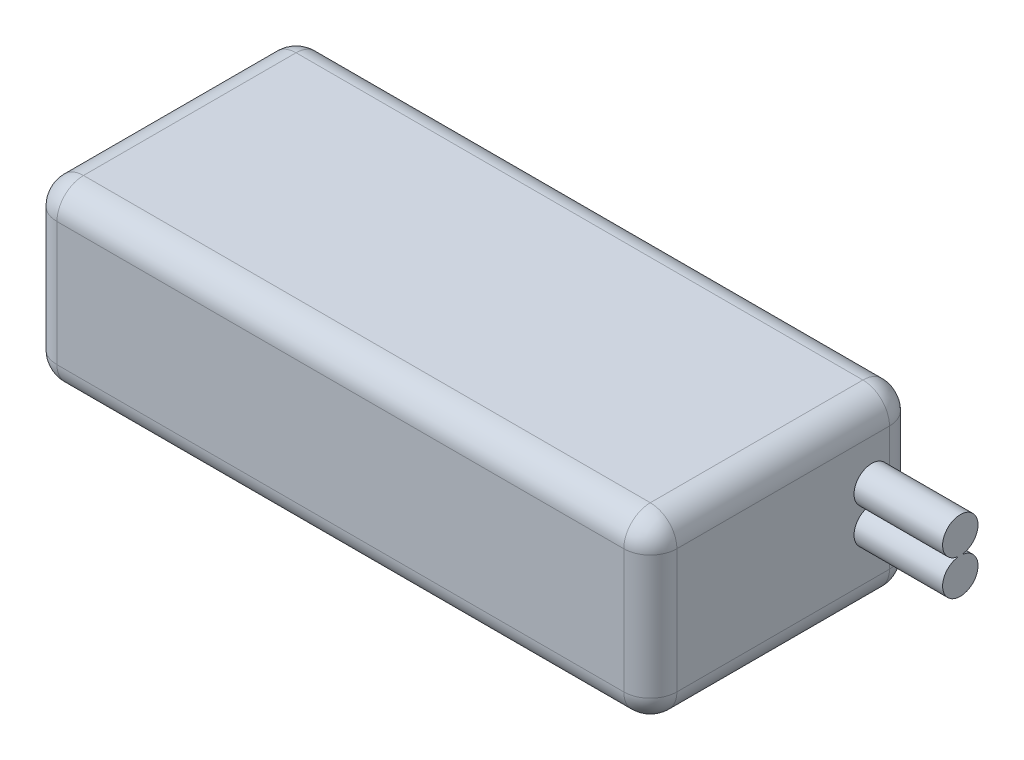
from build123d import *

# Parameters (mm, degrees)
SKETCH2_W           = 70
SKETCH2_H           = 30
BOSS_EXTRUDE1_DEPTH = 20
FILLET1_R           = 3
BOSS_EXTRUDE3_DEPTH = 10


with BuildPart() as part:
    # Sketch2 → Boss-Extrude1 (new body)
    with BuildSketch(Plane(origin=(0, 0, 0), x_dir=(1, 0, 0), z_dir=(0, 1, 0))):
        with Locations((35, 15)):
            Rectangle(SKETCH2_W, SKETCH2_H)
    extrude(amount=BOSS_EXTRUDE1_DEPTH)

    # Fillet1
    fillet1_edges = [part.edges().sort_by_distance(p)[0] for p in [
        (70, 20, -15),
        (35, 20, -30),
        (0, 20, -15),
        (35, 0, -30),
        (70, 0, -15),
        (35, 0, 0),
        (0, 0, -15),
        (0, 10, -30),
        (70, 10, -30),
        (70, 10, 0),
        (0, 10, 0),
        (35, 20, 0),
    ]]
    fillet(fillet1_edges, radius=FILLET1_R)

    # Sketch4 → Boss-Extrude3 (add)
    with BuildSketch(Plane(origin=(70, 0, 0), x_dir=(0, 0, -1), z_dir=(1, 0, 0))):
        with BuildLine():
            Line((24.677955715, 10.366951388), (24.677955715, 10.314754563))
            ThreePointArc((24.677955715, 10.314754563), (25, 6.340852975), (25.322044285, 10.314754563))
            Line((25.322044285, 10.314754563), (25.322044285, 10.366951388))
            ThreePointArc((25.322044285, 10.366951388), (25, 14.340852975), (24.677955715, 10.366951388))
        make_face()
    extrude(amount=BOSS_EXTRUDE3_DEPTH)


solid = part.part
